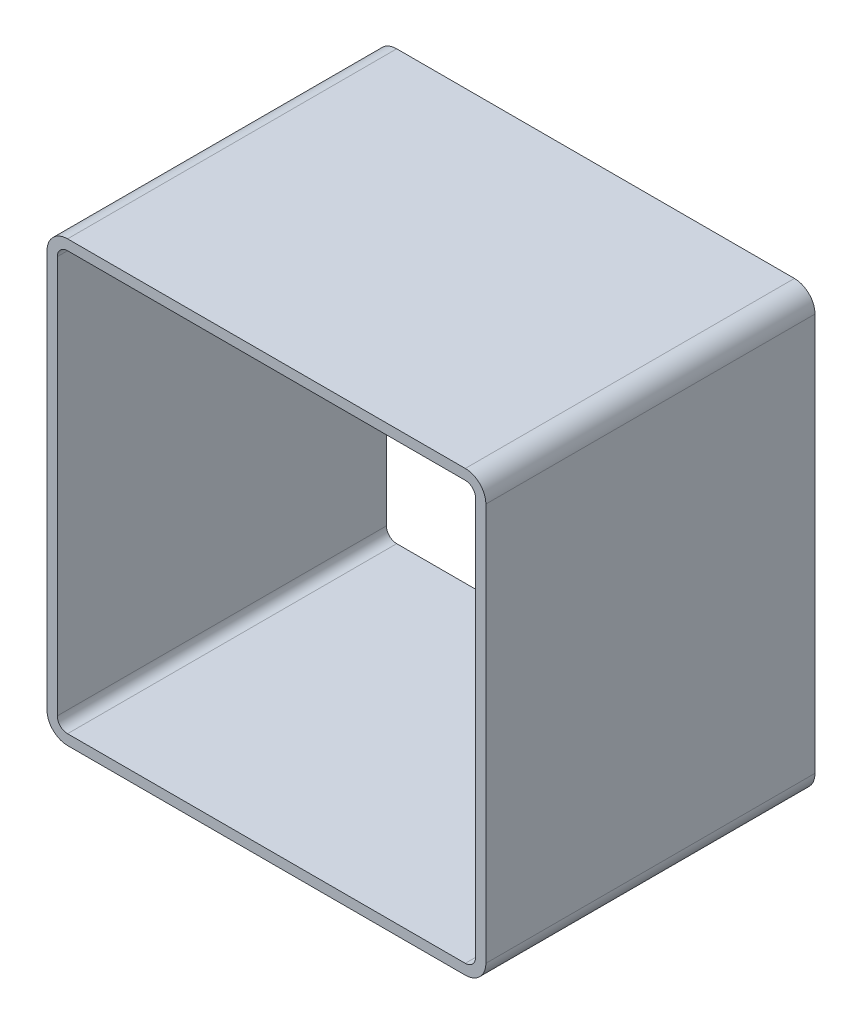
ISO-10303-21;
HEADER;
FILE_DESCRIPTION(('STEP AP214'),'2;1');
FILE_NAME('part.step','',(''),(''),'','','');
FILE_SCHEMA(('AUTOMOTIVE_DESIGN { 1 0 10303 214 1 1 1 1 }'));
ENDSEC;
DATA;
#1=APPLICATION_CONTEXT('core data for automotive mechanical design processes');
#2=APPLICATION_PROTOCOL_DEFINITION('international standard','automotive_design',2000,#1);
#3=PRODUCT_CONTEXT('',#1,'mechanical');
#4=PRODUCT('Part','Part','',(#3));
#5=PRODUCT_RELATED_PRODUCT_CATEGORY('part','',(#4));
#6=PRODUCT_DEFINITION_FORMATION('','',#4);
#7=PRODUCT_DEFINITION_CONTEXT('part definition',#1,'design');
#8=PRODUCT_DEFINITION('design','',#6,#7);
#9=PRODUCT_DEFINITION_SHAPE('','',#8);
#10=(LENGTH_UNIT() NAMED_UNIT(*) SI_UNIT(.MILLI.,.METRE.));
#11=(NAMED_UNIT(*) PLANE_ANGLE_UNIT() SI_UNIT($,.RADIAN.));
#12=(NAMED_UNIT(*) SI_UNIT($,.STERADIAN.) SOLID_ANGLE_UNIT());
#13=UNCERTAINTY_MEASURE_WITH_UNIT(LENGTH_MEASURE(1.E-05),#10,'distance_accuracy_value','');
#14=(GEOMETRIC_REPRESENTATION_CONTEXT(3) GLOBAL_UNCERTAINTY_ASSIGNED_CONTEXT((#13)) GLOBAL_UNIT_ASSIGNED_CONTEXT((#10,
#11,#12)) REPRESENTATION_CONTEXT('',''));
#15=CARTESIAN_POINT('',(0.,0.,0.));
#16=DIRECTION('',(0.,0.,1.));
#17=DIRECTION('',(1.,0.,0.));
#18=AXIS2_PLACEMENT_3D('',#15,#16,#17);
#19=CARTESIAN_POINT('',(19.872465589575,389.132862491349,304.8));
#20=DIRECTION('',(0.,0.,1.));
#21=DIRECTION('',(1.,0.,0.));
#22=AXIS2_PLACEMENT_3D('',#19,#20,#21);
#23=PLANE('',#22);
#24=CARTESIAN_POINT('',(19.872465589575,389.132862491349,304.8));
#25=DIRECTION('',(0.,0.,1.));
#26=DIRECTION('',(1.,0.,0.));
#27=AXIS2_PLACEMENT_3D('',#24,#25,#26);
#28=CIRCLE('',#27,19.05);
#29=CARTESIAN_POINT('',(19.872465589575,408.182862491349,304.8));
#30=VERTEX_POINT('',#29);
#31=CARTESIAN_POINT('',(0.82246558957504,389.132862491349,304.8));
#32=VERTEX_POINT('',#31);
#33=EDGE_CURVE('E211',#30,#32,#28,.T.);
#34=ORIENTED_EDGE('',*,*,#33,.T.);
#35=DIRECTION('',(0.,-1.,0.));
#36=VECTOR('',#35,1.);
#37=CARTESIAN_POINT('',(0.82246558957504,20.8328624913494,304.8));
#38=LINE('',#37,#36);
#39=CARTESIAN_POINT('',(0.822465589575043,20.8328624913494,304.8));
#40=VERTEX_POINT('',#39);
#41=EDGE_CURVE('E214',#32,#40,#38,.T.);
#42=ORIENTED_EDGE('',*,*,#41,.T.);
#43=CARTESIAN_POINT('',(19.872465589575,20.8328624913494,304.8));
#44=DIRECTION('',(0.,0.,1.));
#45=DIRECTION('',(1.,0.,0.));
#46=AXIS2_PLACEMENT_3D('',#43,#44,#45);
#47=CIRCLE('',#46,19.05);
#48=CARTESIAN_POINT('',(19.872465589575,1.78286249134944,304.8));
#49=VERTEX_POINT('',#48);
#50=EDGE_CURVE('E217',#40,#49,#47,.T.);
#51=ORIENTED_EDGE('',*,*,#50,.T.);
#52=DIRECTION('',(1.,0.,0.));
#53=VECTOR('',#52,1.);
#54=CARTESIAN_POINT('',(388.172465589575,1.78286249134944,304.8));
#55=LINE('',#54,#53);
#56=CARTESIAN_POINT('',(388.172465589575,1.78286249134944,304.8));
#57=VERTEX_POINT('',#56);
#58=EDGE_CURVE('E219',#49,#57,#55,.T.);
#59=ORIENTED_EDGE('',*,*,#58,.T.);
#60=CARTESIAN_POINT('',(388.172465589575,20.8328624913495,304.8));
#61=DIRECTION('',(0.,0.,1.));
#62=DIRECTION('',(1.,0.,0.));
#63=AXIS2_PLACEMENT_3D('',#60,#61,#62);
#64=CIRCLE('',#63,19.05);
#65=CARTESIAN_POINT('',(407.222465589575,20.8328624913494,304.8));
#66=VERTEX_POINT('',#65);
#67=EDGE_CURVE('E221',#57,#66,#64,.T.);
#68=ORIENTED_EDGE('',*,*,#67,.T.);
#69=DIRECTION('',(0.,1.,0.));
#70=VECTOR('',#69,1.);
#71=CARTESIAN_POINT('',(407.222465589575,389.132862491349,304.8));
#72=LINE('',#71,#70);
#73=CARTESIAN_POINT('',(407.222465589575,389.132862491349,304.8));
#74=VERTEX_POINT('',#73);
#75=EDGE_CURVE('E223',#66,#74,#72,.T.);
#76=ORIENTED_EDGE('',*,*,#75,.T.);
#77=CARTESIAN_POINT('',(388.172465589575,389.132862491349,304.8));
#78=DIRECTION('',(0.,0.,1.));
#79=DIRECTION('',(1.,0.,0.));
#80=AXIS2_PLACEMENT_3D('',#77,#78,#79);
#81=CIRCLE('',#80,19.05);
#82=CARTESIAN_POINT('',(388.172465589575,408.182862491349,304.8));
#83=VERTEX_POINT('',#82);
#84=EDGE_CURVE('E225',#74,#83,#81,.T.);
#85=ORIENTED_EDGE('',*,*,#84,.T.);
#86=DIRECTION('',(-1.,0.,0.));
#87=VECTOR('',#86,1.);
#88=CARTESIAN_POINT('',(19.872465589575,408.182862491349,304.8));
#89=LINE('',#88,#87);
#90=EDGE_CURVE('E227',#83,#30,#89,.T.);
#91=ORIENTED_EDGE('',*,*,#90,.T.);
#92=EDGE_LOOP('',(#34,#42,#51,#59,#68,#76,#85,#91));
#93=FACE_BOUND('',#92,.T.);
#94=DIRECTION('',(0.,-1.,0.));
#95=VECTOR('',#94,1.);
#96=CARTESIAN_POINT('',(10.347465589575,20.8328624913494,304.8));
#97=LINE('',#96,#95);
#98=CARTESIAN_POINT('',(10.347465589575,389.132862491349,304.8));
#99=VERTEX_POINT('',#98);
#100=CARTESIAN_POINT('',(10.347465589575,20.8328624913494,304.8));
#101=VERTEX_POINT('',#100);
#102=EDGE_CURVE('E154',#99,#101,#97,.T.);
#103=ORIENTED_EDGE('',*,*,#102,.F.);
#104=CARTESIAN_POINT('',(19.872465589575,389.132862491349,304.8));
#105=DIRECTION('',(0.,0.,1.));
#106=DIRECTION('',(1.,0.,0.));
#107=AXIS2_PLACEMENT_3D('',#104,#105,#106);
#108=CIRCLE('',#107,9.525);
#109=CARTESIAN_POINT('',(19.872465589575,398.657862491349,304.8));
#110=VERTEX_POINT('',#109);
#111=EDGE_CURVE('E146',#110,#99,#108,.T.);
#112=ORIENTED_EDGE('',*,*,#111,.F.);
#113=DIRECTION('',(-1.,0.,0.));
#114=VECTOR('',#113,1.);
#115=CARTESIAN_POINT('',(19.872465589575,398.657862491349,304.8));
#116=LINE('',#115,#114);
#117=CARTESIAN_POINT('',(388.172465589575,398.657862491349,304.8));
#118=VERTEX_POINT('',#117);
#119=EDGE_CURVE('E179',#118,#110,#116,.T.);
#120=ORIENTED_EDGE('',*,*,#119,.F.);
#121=CARTESIAN_POINT('',(388.172465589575,389.132862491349,304.8));
#122=DIRECTION('',(0.,0.,1.));
#123=DIRECTION('',(1.,0.,0.));
#124=AXIS2_PLACEMENT_3D('',#121,#122,#123);
#125=CIRCLE('',#124,9.52500000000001);
#126=CARTESIAN_POINT('',(397.697465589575,389.132862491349,304.8));
#127=VERTEX_POINT('',#126);
#128=EDGE_CURVE('E177',#127,#118,#125,.T.);
#129=ORIENTED_EDGE('',*,*,#128,.F.);
#130=DIRECTION('',(0.,1.,0.));
#131=VECTOR('',#130,1.);
#132=CARTESIAN_POINT('',(397.697465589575,389.132862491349,304.8));
#133=LINE('',#132,#131);
#134=CARTESIAN_POINT('',(397.697465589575,20.8328624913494,304.8));
#135=VERTEX_POINT('',#134);
#136=EDGE_CURVE('E175',#135,#127,#133,.T.);
#137=ORIENTED_EDGE('',*,*,#136,.F.);
#138=CARTESIAN_POINT('',(388.172465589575,20.8328624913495,304.8));
#139=DIRECTION('',(0.,0.,1.));
#140=DIRECTION('',(1.,0.,0.));
#141=AXIS2_PLACEMENT_3D('',#138,#139,#140);
#142=CIRCLE('',#141,9.52500000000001);
#143=CARTESIAN_POINT('',(388.172465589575,11.3078624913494,304.8));
#144=VERTEX_POINT('',#143);
#145=EDGE_CURVE('E173',#144,#135,#142,.T.);
#146=ORIENTED_EDGE('',*,*,#145,.F.);
#147=DIRECTION('',(1.,0.,0.));
#148=VECTOR('',#147,1.);
#149=CARTESIAN_POINT('',(388.172465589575,11.3078624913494,304.8));
#150=LINE('',#149,#148);
#151=CARTESIAN_POINT('',(19.872465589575,11.3078624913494,304.8));
#152=VERTEX_POINT('',#151);
#153=EDGE_CURVE('E169',#152,#144,#150,.T.);
#154=ORIENTED_EDGE('',*,*,#153,.F.);
#155=CARTESIAN_POINT('',(19.872465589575,20.8328624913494,304.8));
#156=DIRECTION('',(0.,0.,1.));
#157=DIRECTION('',(1.,0.,0.));
#158=AXIS2_PLACEMENT_3D('',#155,#156,#157);
#159=CIRCLE('',#158,9.525);
#160=EDGE_CURVE('E167',#101,#152,#159,.T.);
#161=ORIENTED_EDGE('',*,*,#160,.F.);
#162=EDGE_LOOP('',(#103,#112,#120,#129,#137,#146,#154,#161));
#163=FACE_BOUND('',#162,.T.);
#164=ADVANCED_FACE('F33',(#93,#163),#23,.T.);
#165=CARTESIAN_POINT('',(19.872465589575,389.132862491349,0.));
#166=DIRECTION('',(0.,0.,1.));
#167=DIRECTION('',(1.,0.,0.));
#168=AXIS2_PLACEMENT_3D('',#165,#166,#167);
#169=PLANE('',#168);
#170=CARTESIAN_POINT('',(19.872465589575,389.132862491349,0.));
#171=DIRECTION('',(0.,0.,1.));
#172=DIRECTION('',(1.,0.,0.));
#173=AXIS2_PLACEMENT_3D('',#170,#171,#172);
#174=CIRCLE('',#173,19.05);
#175=CARTESIAN_POINT('',(19.872465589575,408.182862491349,0.));
#176=VERTEX_POINT('',#175);
#177=CARTESIAN_POINT('',(0.82246558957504,389.132862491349,0.));
#178=VERTEX_POINT('',#177);
#179=EDGE_CURVE('E162',#176,#178,#174,.T.);
#180=ORIENTED_EDGE('',*,*,#179,.F.);
#181=DIRECTION('',(-1.,0.,0.));
#182=VECTOR('',#181,1.);
#183=CARTESIAN_POINT('',(19.872465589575,408.182862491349,0.));
#184=LINE('',#183,#182);
#185=CARTESIAN_POINT('',(388.172465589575,408.182862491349,0.));
#186=VERTEX_POINT('',#185);
#187=EDGE_CURVE('E215',#186,#176,#184,.T.);
#188=ORIENTED_EDGE('',*,*,#187,.F.);
#189=CARTESIAN_POINT('',(388.172465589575,389.132862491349,0.));
#190=DIRECTION('',(0.,0.,1.));
#191=DIRECTION('',(1.,0.,0.));
#192=AXIS2_PLACEMENT_3D('',#189,#190,#191);
#193=CIRCLE('',#192,19.05);
#194=CARTESIAN_POINT('',(407.222465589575,389.132862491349,0.));
#195=VERTEX_POINT('',#194);
#196=EDGE_CURVE('E242',#195,#186,#193,.T.);
#197=ORIENTED_EDGE('',*,*,#196,.F.);
#198=DIRECTION('',(0.,1.,0.));
#199=VECTOR('',#198,1.);
#200=CARTESIAN_POINT('',(407.222465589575,389.132862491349,0.));
#201=LINE('',#200,#199);
#202=CARTESIAN_POINT('',(407.222465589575,20.8328624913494,0.));
#203=VERTEX_POINT('',#202);
#204=EDGE_CURVE('E240',#203,#195,#201,.T.);
#205=ORIENTED_EDGE('',*,*,#204,.F.);
#206=CARTESIAN_POINT('',(388.172465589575,20.8328624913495,0.));
#207=DIRECTION('',(0.,0.,1.));
#208=DIRECTION('',(1.,0.,0.));
#209=AXIS2_PLACEMENT_3D('',#206,#207,#208);
#210=CIRCLE('',#209,19.05);
#211=CARTESIAN_POINT('',(388.172465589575,1.78286249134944,0.));
#212=VERTEX_POINT('',#211);
#213=EDGE_CURVE('E238',#212,#203,#210,.T.);
#214=ORIENTED_EDGE('',*,*,#213,.F.);
#215=DIRECTION('',(1.,0.,0.));
#216=VECTOR('',#215,1.);
#217=CARTESIAN_POINT('',(388.172465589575,1.78286249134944,0.));
#218=LINE('',#217,#216);
#219=CARTESIAN_POINT('',(19.872465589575,1.78286249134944,0.));
#220=VERTEX_POINT('',#219);
#221=EDGE_CURVE('E236',#220,#212,#218,.T.);
#222=ORIENTED_EDGE('',*,*,#221,.F.);
#223=CARTESIAN_POINT('',(19.872465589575,20.8328624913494,0.));
#224=DIRECTION('',(0.,0.,1.));
#225=DIRECTION('',(1.,0.,0.));
#226=AXIS2_PLACEMENT_3D('',#223,#224,#225);
#227=CIRCLE('',#226,19.05);
#228=CARTESIAN_POINT('',(0.822465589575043,20.8328624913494,0.));
#229=VERTEX_POINT('',#228);
#230=EDGE_CURVE('E234',#229,#220,#227,.T.);
#231=ORIENTED_EDGE('',*,*,#230,.F.);
#232=DIRECTION('',(0.,-1.,0.));
#233=VECTOR('',#232,1.);
#234=CARTESIAN_POINT('',(0.82246558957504,20.8328624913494,0.));
#235=LINE('',#234,#233);
#236=EDGE_CURVE('E232',#178,#229,#235,.T.);
#237=ORIENTED_EDGE('',*,*,#236,.F.);
#238=EDGE_LOOP('',(#180,#188,#197,#205,#214,#222,#231,#237));
#239=FACE_BOUND('',#238,.T.);
#240=CARTESIAN_POINT('',(19.872465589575,389.132862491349,0.));
#241=DIRECTION('',(0.,0.,1.));
#242=DIRECTION('',(1.,0.,0.));
#243=AXIS2_PLACEMENT_3D('',#240,#241,#242);
#244=CIRCLE('',#243,9.525);
#245=CARTESIAN_POINT('',(19.872465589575,398.657862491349,0.));
#246=VERTEX_POINT('',#245);
#247=CARTESIAN_POINT('',(10.347465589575,389.132862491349,0.));
#248=VERTEX_POINT('',#247);
#249=EDGE_CURVE('E56',#246,#248,#244,.T.);
#250=ORIENTED_EDGE('',*,*,#249,.T.);
#251=DIRECTION('',(0.,-1.,0.));
#252=VECTOR('',#251,1.);
#253=CARTESIAN_POINT('',(10.347465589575,20.8328624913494,0.));
#254=LINE('',#253,#252);
#255=CARTESIAN_POINT('',(10.347465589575,20.8328624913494,0.));
#256=VERTEX_POINT('',#255);
#257=EDGE_CURVE('E161',#248,#256,#254,.T.);
#258=ORIENTED_EDGE('',*,*,#257,.T.);
#259=CARTESIAN_POINT('',(19.872465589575,20.8328624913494,0.));
#260=DIRECTION('',(0.,0.,1.));
#261=DIRECTION('',(1.,0.,0.));
#262=AXIS2_PLACEMENT_3D('',#259,#260,#261);
#263=CIRCLE('',#262,9.525);
#264=CARTESIAN_POINT('',(19.872465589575,11.3078624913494,0.));
#265=VERTEX_POINT('',#264);
#266=EDGE_CURVE('E183',#256,#265,#263,.T.);
#267=ORIENTED_EDGE('',*,*,#266,.T.);
#268=DIRECTION('',(1.,0.,0.));
#269=VECTOR('',#268,1.);
#270=CARTESIAN_POINT('',(388.172465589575,11.3078624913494,0.));
#271=LINE('',#270,#269);
#272=CARTESIAN_POINT('',(388.172465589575,11.3078624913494,0.));
#273=VERTEX_POINT('',#272);
#274=EDGE_CURVE('E186',#265,#273,#271,.T.);
#275=ORIENTED_EDGE('',*,*,#274,.T.);
#276=CARTESIAN_POINT('',(388.172465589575,20.8328624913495,0.));
#277=DIRECTION('',(0.,0.,1.));
#278=DIRECTION('',(1.,0.,0.));
#279=AXIS2_PLACEMENT_3D('',#276,#277,#278);
#280=CIRCLE('',#279,9.52500000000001);
#281=CARTESIAN_POINT('',(397.697465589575,20.8328624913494,0.));
#282=VERTEX_POINT('',#281);
#283=EDGE_CURVE('E189',#273,#282,#280,.T.);
#284=ORIENTED_EDGE('',*,*,#283,.T.);
#285=DIRECTION('',(0.,1.,0.));
#286=VECTOR('',#285,1.);
#287=CARTESIAN_POINT('',(397.697465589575,389.132862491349,0.));
#288=LINE('',#287,#286);
#289=CARTESIAN_POINT('',(397.697465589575,389.132862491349,0.));
#290=VERTEX_POINT('',#289);
#291=EDGE_CURVE('E192',#282,#290,#288,.T.);
#292=ORIENTED_EDGE('',*,*,#291,.T.);
#293=CARTESIAN_POINT('',(388.172465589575,389.132862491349,0.));
#294=DIRECTION('',(0.,0.,1.));
#295=DIRECTION('',(1.,0.,0.));
#296=AXIS2_PLACEMENT_3D('',#293,#294,#295);
#297=CIRCLE('',#296,9.52500000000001);
#298=CARTESIAN_POINT('',(388.172465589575,398.657862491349,0.));
#299=VERTEX_POINT('',#298);
#300=EDGE_CURVE('E195',#290,#299,#297,.T.);
#301=ORIENTED_EDGE('',*,*,#300,.T.);
#302=DIRECTION('',(-1.,0.,0.));
#303=VECTOR('',#302,1.);
#304=CARTESIAN_POINT('',(19.872465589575,398.657862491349,0.));
#305=LINE('',#304,#303);
#306=EDGE_CURVE('E155',#299,#246,#305,.T.);
#307=ORIENTED_EDGE('',*,*,#306,.T.);
#308=EDGE_LOOP('',(#250,#258,#267,#275,#284,#292,#301,#307));
#309=FACE_BOUND('',#308,.T.);
#310=ADVANCED_FACE('F272',(#239,#309),#169,.F.);
#311=CARTESIAN_POINT('',(19.872465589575,389.132862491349,304.8));
#312=DIRECTION('',(0.,0.,-1.));
#313=DIRECTION('',(-1.,0.,0.));
#314=AXIS2_PLACEMENT_3D('',#311,#312,#313);
#315=CYLINDRICAL_SURFACE('',#314,19.05);
#316=ORIENTED_EDGE('',*,*,#179,.T.);
#317=DIRECTION('',(0.,0.,-1.));
#318=VECTOR('',#317,1.);
#319=CARTESIAN_POINT('',(0.82246558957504,389.132862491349,304.8));
#320=LINE('',#319,#318);
#321=EDGE_CURVE('E11',#32,#178,#320,.T.);
#322=ORIENTED_EDGE('',*,*,#321,.F.);
#323=ORIENTED_EDGE('',*,*,#33,.F.);
#324=DIRECTION('',(0.,0.,-1.));
#325=VECTOR('',#324,1.);
#326=CARTESIAN_POINT('',(19.872465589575,408.182862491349,304.8));
#327=LINE('',#326,#325);
#328=EDGE_CURVE('E229',#30,#176,#327,.T.);
#329=ORIENTED_EDGE('',*,*,#328,.T.);
#330=EDGE_LOOP('',(#316,#322,#323,#329));
#331=FACE_BOUND('',#330,.T.);
#332=ADVANCED_FACE('F35',(#331),#315,.T.);
#333=CARTESIAN_POINT('',(0.82246558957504,20.8328624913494,304.8));
#334=DIRECTION('',(1.,0.,0.));
#335=DIRECTION('',(0.,0.,-1.));
#336=AXIS2_PLACEMENT_3D('',#333,#334,#335);
#337=PLANE('',#336);
#338=ORIENTED_EDGE('',*,*,#236,.T.);
#339=DIRECTION('',(0.,0.,-1.));
#340=VECTOR('',#339,1.);
#341=CARTESIAN_POINT('',(0.822465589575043,20.8328624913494,304.8));
#342=LINE('',#341,#340);
#343=EDGE_CURVE('E41',#40,#229,#342,.T.);
#344=ORIENTED_EDGE('',*,*,#343,.F.);
#345=ORIENTED_EDGE('',*,*,#41,.F.);
#346=ORIENTED_EDGE('',*,*,#321,.T.);
#347=EDGE_LOOP('',(#338,#344,#345,#346));
#348=FACE_BOUND('',#347,.T.);
#349=ADVANCED_FACE('F289',(#348),#337,.F.);
#350=CARTESIAN_POINT('',(19.872465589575,20.8328624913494,304.8));
#351=DIRECTION('',(0.,0.,-1.));
#352=DIRECTION('',(-1.,0.,0.));
#353=AXIS2_PLACEMENT_3D('',#350,#351,#352);
#354=CYLINDRICAL_SURFACE('',#353,19.05);
#355=ORIENTED_EDGE('',*,*,#230,.T.);
#356=DIRECTION('',(0.,0.,-1.));
#357=VECTOR('',#356,1.);
#358=CARTESIAN_POINT('',(19.872465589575,1.78286249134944,304.8));
#359=LINE('',#358,#357);
#360=EDGE_CURVE('E259',#49,#220,#359,.T.);
#361=ORIENTED_EDGE('',*,*,#360,.F.);
#362=ORIENTED_EDGE('',*,*,#50,.F.);
#363=ORIENTED_EDGE('',*,*,#343,.T.);
#364=EDGE_LOOP('',(#355,#361,#362,#363));
#365=FACE_BOUND('',#364,.T.);
#366=ADVANCED_FACE('F266',(#365),#354,.T.);
#367=CARTESIAN_POINT('',(388.172465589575,1.78286249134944,304.8));
#368=DIRECTION('',(0.,1.,0.));
#369=DIRECTION('',(0.,0.,1.));
#370=AXIS2_PLACEMENT_3D('',#367,#368,#369);
#371=PLANE('',#370);
#372=ORIENTED_EDGE('',*,*,#221,.T.);
#373=DIRECTION('',(0.,0.,-1.));
#374=VECTOR('',#373,1.);
#375=CARTESIAN_POINT('',(388.172465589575,1.78286249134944,304.8));
#376=LINE('',#375,#374);
#377=EDGE_CURVE('E256',#57,#212,#376,.T.);
#378=ORIENTED_EDGE('',*,*,#377,.F.);
#379=ORIENTED_EDGE('',*,*,#58,.F.);
#380=ORIENTED_EDGE('',*,*,#360,.T.);
#381=EDGE_LOOP('',(#372,#378,#379,#380));
#382=FACE_BOUND('',#381,.T.);
#383=ADVANCED_FACE('F278',(#382),#371,.F.);
#384=CARTESIAN_POINT('',(388.172465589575,20.8328624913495,304.8));
#385=DIRECTION('',(0.,0.,-1.));
#386=DIRECTION('',(-1.,0.,0.));
#387=AXIS2_PLACEMENT_3D('',#384,#385,#386);
#388=CYLINDRICAL_SURFACE('',#387,19.05);
#389=ORIENTED_EDGE('',*,*,#213,.T.);
#390=DIRECTION('',(0.,0.,-1.));
#391=VECTOR('',#390,1.);
#392=CARTESIAN_POINT('',(407.222465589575,20.8328624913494,304.8));
#393=LINE('',#392,#391);
#394=EDGE_CURVE('E253',#66,#203,#393,.T.);
#395=ORIENTED_EDGE('',*,*,#394,.F.);
#396=ORIENTED_EDGE('',*,*,#67,.F.);
#397=ORIENTED_EDGE('',*,*,#377,.T.);
#398=EDGE_LOOP('',(#389,#395,#396,#397));
#399=FACE_BOUND('',#398,.T.);
#400=ADVANCED_FACE('F282',(#399),#388,.T.);
#401=CARTESIAN_POINT('',(407.222465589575,389.132862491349,304.8));
#402=DIRECTION('',(-1.,0.,0.));
#403=DIRECTION('',(0.,0.,1.));
#404=AXIS2_PLACEMENT_3D('',#401,#402,#403);
#405=PLANE('',#404);
#406=ORIENTED_EDGE('',*,*,#204,.T.);
#407=DIRECTION('',(0.,0.,-1.));
#408=VECTOR('',#407,1.);
#409=CARTESIAN_POINT('',(407.222465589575,389.132862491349,304.8));
#410=LINE('',#409,#408);
#411=EDGE_CURVE('E250',#74,#195,#410,.T.);
#412=ORIENTED_EDGE('',*,*,#411,.F.);
#413=ORIENTED_EDGE('',*,*,#75,.F.);
#414=ORIENTED_EDGE('',*,*,#394,.T.);
#415=EDGE_LOOP('',(#406,#412,#413,#414));
#416=FACE_BOUND('',#415,.T.);
#417=ADVANCED_FACE('F302',(#416),#405,.F.);
#418=CARTESIAN_POINT('',(388.172465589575,389.132862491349,304.8));
#419=DIRECTION('',(0.,0.,-1.));
#420=DIRECTION('',(-1.,0.,0.));
#421=AXIS2_PLACEMENT_3D('',#418,#419,#420);
#422=CYLINDRICAL_SURFACE('',#421,19.05);
#423=ORIENTED_EDGE('',*,*,#196,.T.);
#424=DIRECTION('',(0.,0.,-1.));
#425=VECTOR('',#424,1.);
#426=CARTESIAN_POINT('',(388.172465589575,408.182862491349,304.8));
#427=LINE('',#426,#425);
#428=EDGE_CURVE('E247',#83,#186,#427,.T.);
#429=ORIENTED_EDGE('',*,*,#428,.F.);
#430=ORIENTED_EDGE('',*,*,#84,.F.);
#431=ORIENTED_EDGE('',*,*,#411,.T.);
#432=EDGE_LOOP('',(#423,#429,#430,#431));
#433=FACE_BOUND('',#432,.T.);
#434=ADVANCED_FACE('F300',(#433),#422,.T.);
#435=CARTESIAN_POINT('',(19.872465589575,408.182862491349,304.8));
#436=DIRECTION('',(0.,-1.,0.));
#437=DIRECTION('',(0.,0.,-1.));
#438=AXIS2_PLACEMENT_3D('',#435,#436,#437);
#439=PLANE('',#438);
#440=ORIENTED_EDGE('',*,*,#187,.T.);
#441=ORIENTED_EDGE('',*,*,#328,.F.);
#442=ORIENTED_EDGE('',*,*,#90,.F.);
#443=ORIENTED_EDGE('',*,*,#428,.T.);
#444=EDGE_LOOP('',(#440,#441,#442,#443));
#445=FACE_BOUND('',#444,.T.);
#446=ADVANCED_FACE('F295',(#445),#439,.F.);
#447=CARTESIAN_POINT('',(19.872465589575,389.132862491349,304.8));
#448=DIRECTION('',(0.,0.,-1.));
#449=DIRECTION('',(-1.,0.,0.));
#450=AXIS2_PLACEMENT_3D('',#447,#448,#449);
#451=CYLINDRICAL_SURFACE('',#450,9.525);
#452=ORIENTED_EDGE('',*,*,#249,.F.);
#453=DIRECTION('',(0.,0.,-1.));
#454=VECTOR('',#453,1.);
#455=CARTESIAN_POINT('',(19.872465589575,398.657862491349,304.8));
#456=LINE('',#455,#454);
#457=EDGE_CURVE('E150',#110,#246,#456,.T.);
#458=ORIENTED_EDGE('',*,*,#457,.F.);
#459=ORIENTED_EDGE('',*,*,#111,.T.);
#460=DIRECTION('',(0.,0.,-1.));
#461=VECTOR('',#460,1.);
#462=CARTESIAN_POINT('',(10.347465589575,389.132862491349,304.8));
#463=LINE('',#462,#461);
#464=EDGE_CURVE('E149',#99,#248,#463,.T.);
#465=ORIENTED_EDGE('',*,*,#464,.T.);
#466=EDGE_LOOP('',(#452,#458,#459,#465));
#467=FACE_BOUND('',#466,.T.);
#468=ADVANCED_FACE('F148',(#467),#451,.F.);
#469=CARTESIAN_POINT('',(10.347465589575,20.8328624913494,304.8));
#470=DIRECTION('',(1.,0.,0.));
#471=DIRECTION('',(0.,0.,-1.));
#472=AXIS2_PLACEMENT_3D('',#469,#470,#471);
#473=PLANE('',#472);
#474=ORIENTED_EDGE('',*,*,#257,.F.);
#475=ORIENTED_EDGE('',*,*,#464,.F.);
#476=ORIENTED_EDGE('',*,*,#102,.T.);
#477=DIRECTION('',(0.,0.,-1.));
#478=VECTOR('',#477,1.);
#479=CARTESIAN_POINT('',(10.347465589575,20.8328624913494,304.8));
#480=LINE('',#479,#478);
#481=EDGE_CURVE('E163',#101,#256,#480,.T.);
#482=ORIENTED_EDGE('',*,*,#481,.T.);
#483=EDGE_LOOP('',(#474,#475,#476,#482));
#484=FACE_BOUND('',#483,.T.);
#485=ADVANCED_FACE('F158',(#484),#473,.T.);
#486=CARTESIAN_POINT('',(19.872465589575,20.8328624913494,304.8));
#487=DIRECTION('',(0.,0.,-1.));
#488=DIRECTION('',(-1.,0.,0.));
#489=AXIS2_PLACEMENT_3D('',#486,#487,#488);
#490=CYLINDRICAL_SURFACE('',#489,9.525);
#491=ORIENTED_EDGE('',*,*,#266,.F.);
#492=ORIENTED_EDGE('',*,*,#481,.F.);
#493=ORIENTED_EDGE('',*,*,#160,.T.);
#494=DIRECTION('',(0.,0.,-1.));
#495=VECTOR('',#494,1.);
#496=CARTESIAN_POINT('',(19.872465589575,11.3078624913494,304.8));
#497=LINE('',#496,#495);
#498=EDGE_CURVE('E208',#152,#265,#497,.T.);
#499=ORIENTED_EDGE('',*,*,#498,.T.);
#500=EDGE_LOOP('',(#491,#492,#493,#499));
#501=FACE_BOUND('',#500,.T.);
#502=ADVANCED_FACE('F327',(#501),#490,.F.);
#503=CARTESIAN_POINT('',(388.172465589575,11.3078624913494,304.8));
#504=DIRECTION('',(0.,1.,0.));
#505=DIRECTION('',(0.,0.,1.));
#506=AXIS2_PLACEMENT_3D('',#503,#504,#505);
#507=PLANE('',#506);
#508=ORIENTED_EDGE('',*,*,#274,.F.);
#509=ORIENTED_EDGE('',*,*,#498,.F.);
#510=ORIENTED_EDGE('',*,*,#153,.T.);
#511=DIRECTION('',(0.,0.,-1.));
#512=VECTOR('',#511,1.);
#513=CARTESIAN_POINT('',(388.172465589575,11.3078624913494,304.8));
#514=LINE('',#513,#512);
#515=EDGE_CURVE('E206',#144,#273,#514,.T.);
#516=ORIENTED_EDGE('',*,*,#515,.T.);
#517=EDGE_LOOP('',(#508,#509,#510,#516));
#518=FACE_BOUND('',#517,.T.);
#519=ADVANCED_FACE('F331',(#518),#507,.T.);
#520=CARTESIAN_POINT('',(388.172465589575,20.8328624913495,304.8));
#521=DIRECTION('',(0.,0.,-1.));
#522=DIRECTION('',(-1.,0.,0.));
#523=AXIS2_PLACEMENT_3D('',#520,#521,#522);
#524=CYLINDRICAL_SURFACE('',#523,9.52500000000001);
#525=ORIENTED_EDGE('',*,*,#283,.F.);
#526=ORIENTED_EDGE('',*,*,#515,.F.);
#527=ORIENTED_EDGE('',*,*,#145,.T.);
#528=DIRECTION('',(0.,0.,-1.));
#529=VECTOR('',#528,1.);
#530=CARTESIAN_POINT('',(397.697465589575,20.8328624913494,304.8));
#531=LINE('',#530,#529);
#532=EDGE_CURVE('E204',#135,#282,#531,.T.);
#533=ORIENTED_EDGE('',*,*,#532,.T.);
#534=EDGE_LOOP('',(#525,#526,#527,#533));
#535=FACE_BOUND('',#534,.T.);
#536=ADVANCED_FACE('F337',(#535),#524,.F.);
#537=CARTESIAN_POINT('',(397.697465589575,389.132862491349,304.8));
#538=DIRECTION('',(-1.,0.,0.));
#539=DIRECTION('',(0.,0.,1.));
#540=AXIS2_PLACEMENT_3D('',#537,#538,#539);
#541=PLANE('',#540);
#542=ORIENTED_EDGE('',*,*,#291,.F.);
#543=ORIENTED_EDGE('',*,*,#532,.F.);
#544=ORIENTED_EDGE('',*,*,#136,.T.);
#545=DIRECTION('',(0.,0.,-1.));
#546=VECTOR('',#545,1.);
#547=CARTESIAN_POINT('',(397.697465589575,389.132862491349,304.8));
#548=LINE('',#547,#546);
#549=EDGE_CURVE('E202',#127,#290,#548,.T.);
#550=ORIENTED_EDGE('',*,*,#549,.T.);
#551=EDGE_LOOP('',(#542,#543,#544,#550));
#552=FACE_BOUND('',#551,.T.);
#553=ADVANCED_FACE('F341',(#552),#541,.T.);
#554=CARTESIAN_POINT('',(388.172465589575,389.132862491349,304.8));
#555=DIRECTION('',(0.,0.,-1.));
#556=DIRECTION('',(-1.,0.,0.));
#557=AXIS2_PLACEMENT_3D('',#554,#555,#556);
#558=CYLINDRICAL_SURFACE('',#557,9.52500000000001);
#559=ORIENTED_EDGE('',*,*,#300,.F.);
#560=ORIENTED_EDGE('',*,*,#549,.F.);
#561=ORIENTED_EDGE('',*,*,#128,.T.);
#562=DIRECTION('',(0.,0.,-1.));
#563=VECTOR('',#562,1.);
#564=CARTESIAN_POINT('',(388.172465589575,398.657862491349,304.8));
#565=LINE('',#564,#563);
#566=EDGE_CURVE('E48',#118,#299,#565,.T.);
#567=ORIENTED_EDGE('',*,*,#566,.T.);
#568=EDGE_LOOP('',(#559,#560,#561,#567));
#569=FACE_BOUND('',#568,.T.);
#570=ADVANCED_FACE('F345',(#569),#558,.F.);
#571=CARTESIAN_POINT('',(19.872465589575,398.657862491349,304.8));
#572=DIRECTION('',(0.,-1.,0.));
#573=DIRECTION('',(0.,0.,-1.));
#574=AXIS2_PLACEMENT_3D('',#571,#572,#573);
#575=PLANE('',#574);
#576=ORIENTED_EDGE('',*,*,#306,.F.);
#577=ORIENTED_EDGE('',*,*,#566,.F.);
#578=ORIENTED_EDGE('',*,*,#119,.T.);
#579=ORIENTED_EDGE('',*,*,#457,.T.);
#580=EDGE_LOOP('',(#576,#577,#578,#579));
#581=FACE_BOUND('',#580,.T.);
#582=ADVANCED_FACE('F349',(#581),#575,.T.);
#583=CLOSED_SHELL('',(#164,#310,#332,#349,#366,#383,#400,#417,#434,#446,#468,#485,#502,#519,
#536,#553,#570,#582));
#584=MANIFOLD_SOLID_BREP('B2',#583);
#585=ADVANCED_BREP_SHAPE_REPRESENTATION('',(#18,#584),#14);
#586=SHAPE_DEFINITION_REPRESENTATION(#9,#585);
ENDSEC;
END-ISO-10303-21;
